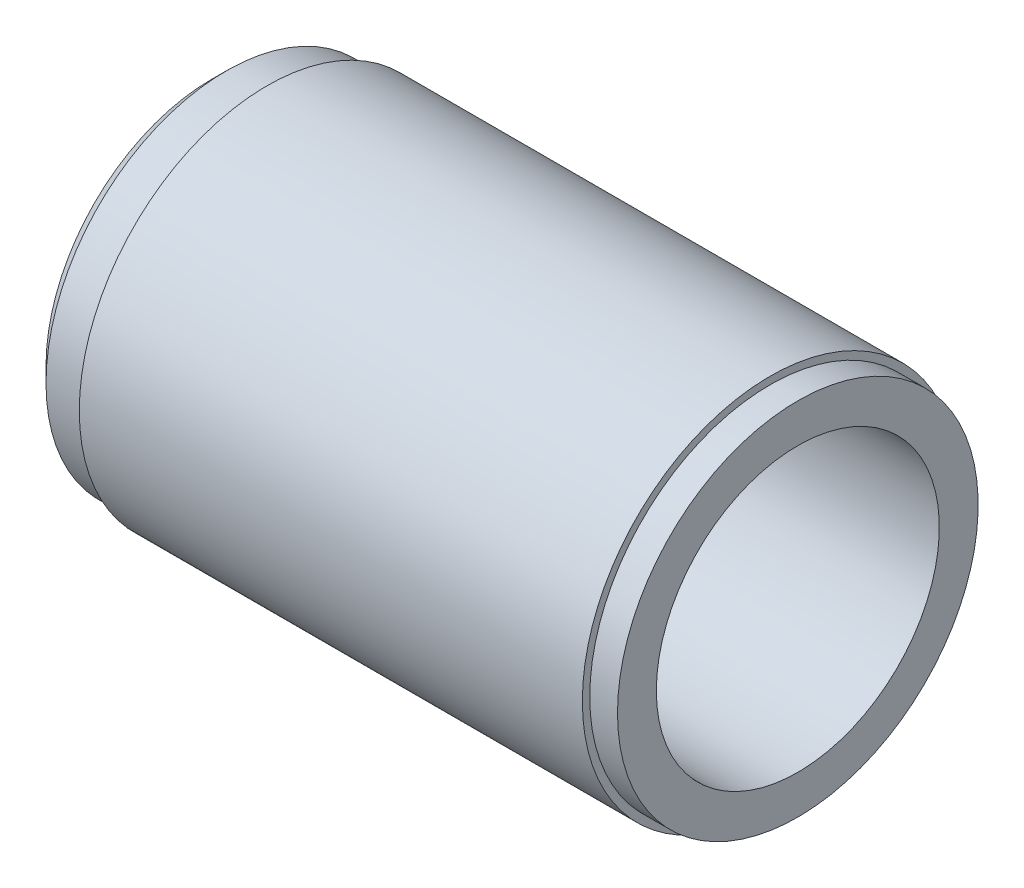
from build123d import *


with BuildPart() as part:
    # Esquisse1 → R_volution1 (revolve)
    with BuildSketch(Plane.XY, mode=Mode.PRIVATE) as r_volution1_sk:
        Polygon((0, 76.5), (0, 89.5), (8, 97.5), (30, 97.5), (30, 101.5), (302, 101.5), (302, 97.5), (317, 97.5), (317, 76.5), align=None)
    revolve(r_volution1_sk.sketch.rotate(Axis((0, 0, 0), (1, 0, 0)), 90), axis=Axis((0, 0, 0), (1, 0, 0)))


solid = part.part
